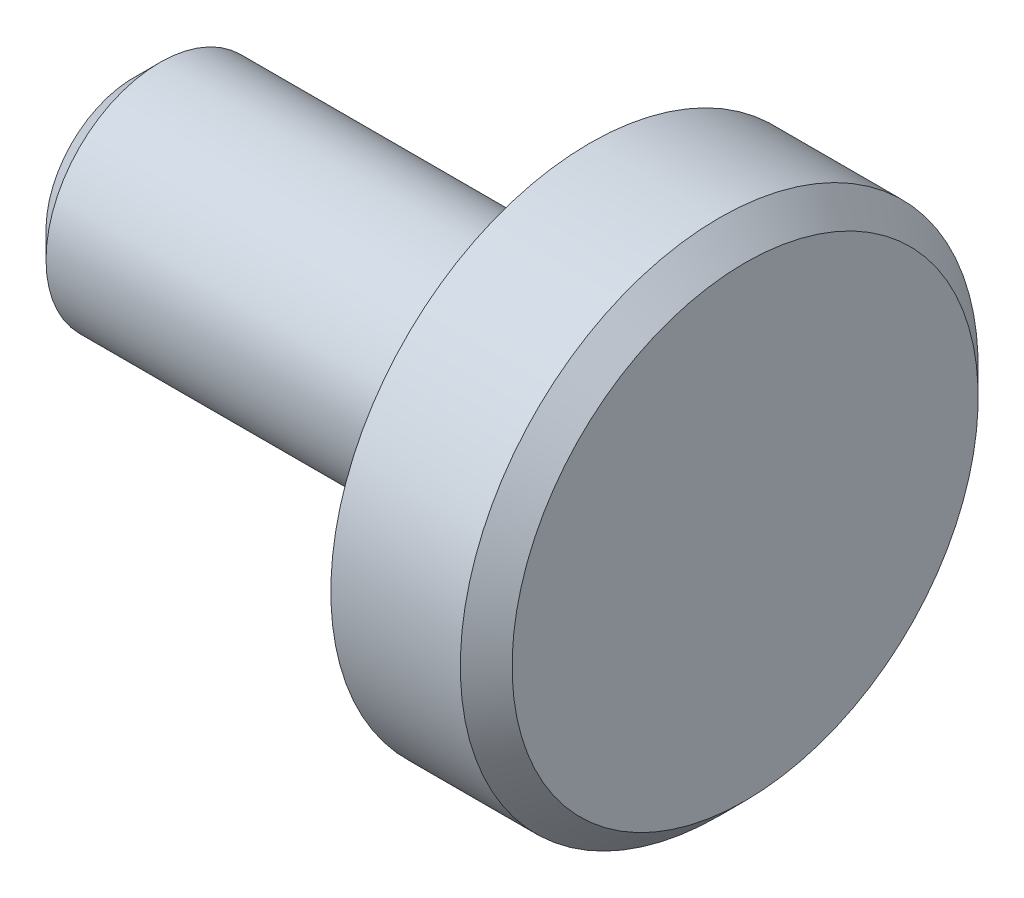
from build123d import *

# Parameters (mm, degrees)
CHAMFER1_SIZE = 0.635


with BuildPart() as part:
    # Sketch1 → Revolve1 (revolve)
    with BuildSketch(Plane.XY):
        Polygon((0, 0), (-14.986, 0), (-14.986, 2.794), (-3.81, 2.794), (-3.81, 6.35), (0, 6.35), align=None)
    revolve(axis=Axis((0, 0, 0), (-1, 0, 0)))

    # Chamfer1
    chamfer1_edges = [part.edges().sort_by_distance(p)[0] for p in [
        (0, -6.35, 0),
        (-14.986, -2.794, 0),
    ]]
    chamfer(chamfer1_edges, length=CHAMFER1_SIZE)


solid = part.part
